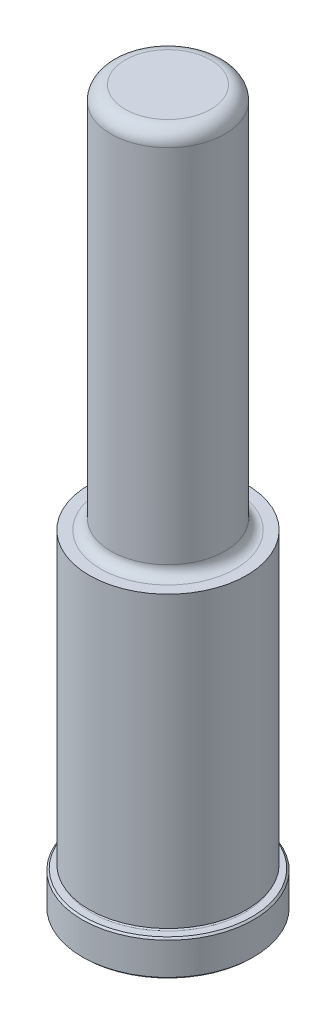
ISO-10303-21;
HEADER;
FILE_DESCRIPTION(('STEP AP214'),'2;1');
FILE_NAME('part.step','',(''),(''),'','','');
FILE_SCHEMA(('AUTOMOTIVE_DESIGN { 1 0 10303 214 1 1 1 1 }'));
ENDSEC;
DATA;
#1=APPLICATION_CONTEXT('core data for automotive mechanical design processes');
#2=APPLICATION_PROTOCOL_DEFINITION('international standard','automotive_design',2000,#1);
#3=PRODUCT_CONTEXT('',#1,'mechanical');
#4=PRODUCT('Part','Part','',(#3));
#5=PRODUCT_RELATED_PRODUCT_CATEGORY('part','',(#4));
#6=PRODUCT_DEFINITION_FORMATION('','',#4);
#7=PRODUCT_DEFINITION_CONTEXT('part definition',#1,'design');
#8=PRODUCT_DEFINITION('design','',#6,#7);
#9=PRODUCT_DEFINITION_SHAPE('','',#8);
#10=(LENGTH_UNIT() NAMED_UNIT(*) SI_UNIT(.MILLI.,.METRE.));
#11=(NAMED_UNIT(*) PLANE_ANGLE_UNIT() SI_UNIT($,.RADIAN.));
#12=(NAMED_UNIT(*) SI_UNIT($,.STERADIAN.) SOLID_ANGLE_UNIT());
#13=UNCERTAINTY_MEASURE_WITH_UNIT(LENGTH_MEASURE(1.E-05),#10,'distance_accuracy_value','');
#14=(GEOMETRIC_REPRESENTATION_CONTEXT(3) GLOBAL_UNCERTAINTY_ASSIGNED_CONTEXT((#13)) GLOBAL_UNIT_ASSIGNED_CONTEXT((#10,
#11,#12)) REPRESENTATION_CONTEXT('',''));
#15=CARTESIAN_POINT('',(0.,0.,0.));
#16=DIRECTION('',(0.,0.,1.));
#17=DIRECTION('',(1.,0.,0.));
#18=AXIS2_PLACEMENT_3D('',#15,#16,#17);
#19=CARTESIAN_POINT('',(0.,0.,0.));
#20=DIRECTION('',(0.,1.,0.));
#21=DIRECTION('',(0.,0.,1.));
#22=AXIS2_PLACEMENT_3D('',#19,#20,#21);
#23=PLANE('',#22);
#24=CARTESIAN_POINT('',(0.,0.,0.));
#25=DIRECTION('',(0.,1.,0.));
#26=DIRECTION('',(0.,0.,1.));
#27=AXIS2_PLACEMENT_3D('',#24,#25,#26);
#28=CIRCLE('',#27,18.669);
#29=CARTESIAN_POINT('',(0.,0.,18.669));
#30=VERTEX_POINT('',#29);
#31=EDGE_CURVE('E46',#30,#30,#28,.F.);
#32=ORIENTED_EDGE('',*,*,#31,.T.);
#33=EDGE_LOOP('',(#32));
#34=FACE_BOUND('',#33,.T.);
#35=ADVANCED_FACE('F31',(#34),#23,.F.);
#36=CARTESIAN_POINT('',(0.,0.,0.));
#37=DIRECTION('',(0.,1.,0.));
#38=DIRECTION('',(0.,0.,1.));
#39=AXIS2_PLACEMENT_3D('',#36,#37,#38);
#40=CYLINDRICAL_SURFACE('',#39,19.05);
#41=CARTESIAN_POINT('',(0.,0.380999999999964,0.));
#42=DIRECTION('',(0.,1.,0.));
#43=DIRECTION('',(0.,0.,1.));
#44=AXIS2_PLACEMENT_3D('',#41,#42,#43);
#45=CIRCLE('',#44,19.05);
#46=CARTESIAN_POINT('',(0.,0.380999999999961,19.05));
#47=VERTEX_POINT('',#46);
#48=EDGE_CURVE('E51',#47,#47,#45,.T.);
#49=ORIENTED_EDGE('',*,*,#48,.T.);
#50=EDGE_LOOP('',(#49));
#51=FACE_BOUND('',#50,.T.);
#52=CARTESIAN_POINT('',(0.,7.54380000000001,0.));
#53=DIRECTION('',(0.,-1.,0.));
#54=DIRECTION('',(0.,0.,-1.));
#55=AXIS2_PLACEMENT_3D('',#52,#53,#54);
#56=CIRCLE('',#55,19.05);
#57=CARTESIAN_POINT('',(0.,7.54380000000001,-19.05));
#58=VERTEX_POINT('',#57);
#59=EDGE_CURVE('E54',#58,#58,#56,.T.);
#60=ORIENTED_EDGE('',*,*,#59,.T.);
#61=EDGE_LOOP('',(#60));
#62=FACE_BOUND('',#61,.T.);
#63=ADVANCED_FACE('F110',(#51,#62),#40,.T.);
#64=CARTESIAN_POINT('',(0.,7.9248,-19.05));
#65=DIRECTION('',(0.,-1.,0.));
#66=DIRECTION('',(0.,0.,-1.));
#67=AXIS2_PLACEMENT_3D('',#64,#65,#66);
#68=PLANE('',#67);
#69=CARTESIAN_POINT('',(0.,7.9248,0.));
#70=DIRECTION('',(0.,-1.,0.));
#71=DIRECTION('',(0.,0.,-1.));
#72=AXIS2_PLACEMENT_3D('',#69,#70,#71);
#73=CIRCLE('',#72,18.669);
#74=CARTESIAN_POINT('',(0.,7.9248,-18.669));
#75=VERTEX_POINT('',#74);
#76=EDGE_CURVE('E42',#75,#75,#73,.F.);
#77=ORIENTED_EDGE('',*,*,#76,.T.);
#78=EDGE_LOOP('',(#77));
#79=FACE_BOUND('',#78,.T.);
#80=CARTESIAN_POINT('',(0.,7.9248,0.));
#81=DIRECTION('',(0.,1.,0.));
#82=DIRECTION('',(0.,0.,1.));
#83=AXIS2_PLACEMENT_3D('',#80,#81,#82);
#84=CIRCLE('',#83,17.0688);
#85=CARTESIAN_POINT('',(0.,7.92479999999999,17.0688));
#86=VERTEX_POINT('',#85);
#87=EDGE_CURVE('E57',#86,#86,#84,.T.);
#88=ORIENTED_EDGE('',*,*,#87,.F.);
#89=EDGE_LOOP('',(#88));
#90=FACE_BOUND('',#89,.T.);
#91=ADVANCED_FACE('F105',(#79,#90),#68,.F.);
#92=CARTESIAN_POINT('',(0.,8.3058,0.));
#93=DIRECTION('',(0.,1.,0.));
#94=DIRECTION('',(0.,0.,1.));
#95=AXIS2_PLACEMENT_3D('',#92,#93,#94);
#96=TOROIDAL_SURFACE('',#95,17.0688,0.381000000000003);
#97=CARTESIAN_POINT('',(0.,8.6868,0.));
#98=DIRECTION('',(0.,1.,0.));
#99=DIRECTION('',(0.,0.,1.));
#100=AXIS2_PLACEMENT_3D('',#97,#98,#99);
#101=CIRCLE('',#100,17.0688);
#102=CARTESIAN_POINT('',(0.,8.6868,17.0688));
#103=VERTEX_POINT('',#102);
#104=EDGE_CURVE('E60',#103,#103,#101,.T.);
#105=ORIENTED_EDGE('',*,*,#104,.F.);
#106=EDGE_LOOP('',(#105));
#107=FACE_BOUND('',#106,.T.);
#108=ORIENTED_EDGE('',*,*,#87,.T.);
#109=EDGE_LOOP('',(#108));
#110=FACE_BOUND('',#109,.T.);
#111=ADVANCED_FACE('F99',(#107,#110),#96,.F.);
#112=CARTESIAN_POINT('',(0.,8.6868,-17.0688));
#113=DIRECTION('',(0.,1.,0.));
#114=DIRECTION('',(0.,0.,1.));
#115=AXIS2_PLACEMENT_3D('',#112,#113,#114);
#116=PLANE('',#115);
#117=CARTESIAN_POINT('',(0.,8.6868,0.));
#118=DIRECTION('',(0.,1.,0.));
#119=DIRECTION('',(0.,0.,1.));
#120=AXIS2_PLACEMENT_3D('',#117,#118,#119);
#121=CIRCLE('',#120,17.4752);
#122=CARTESIAN_POINT('',(0.,8.6868,17.4752));
#123=VERTEX_POINT('',#122);
#124=EDGE_CURVE('E63',#123,#123,#121,.T.);
#125=ORIENTED_EDGE('',*,*,#124,.F.);
#126=EDGE_LOOP('',(#125));
#127=FACE_BOUND('',#126,.T.);
#128=ORIENTED_EDGE('',*,*,#104,.T.);
#129=EDGE_LOOP('',(#128));
#130=FACE_BOUND('',#129,.T.);
#131=ADVANCED_FACE('F93',(#127,#130),#116,.F.);
#132=CARTESIAN_POINT('',(0.,0.,0.));
#133=DIRECTION('',(0.,1.,0.));
#134=DIRECTION('',(0.,0.,1.));
#135=AXIS2_PLACEMENT_3D('',#132,#133,#134);
#136=CYLINDRICAL_SURFACE('',#135,17.4752);
#137=CARTESIAN_POINT('',(0.,73.025,0.));
#138=DIRECTION('',(0.,1.,0.));
#139=DIRECTION('',(0.,0.,1.));
#140=AXIS2_PLACEMENT_3D('',#137,#138,#139);
#141=CIRCLE('',#140,17.4752);
#142=CARTESIAN_POINT('',(0.,73.025,17.4752));
#143=VERTEX_POINT('',#142);
#144=EDGE_CURVE('E66',#143,#143,#141,.T.);
#145=ORIENTED_EDGE('',*,*,#144,.F.);
#146=EDGE_LOOP('',(#145));
#147=FACE_BOUND('',#146,.T.);
#148=ORIENTED_EDGE('',*,*,#124,.T.);
#149=EDGE_LOOP('',(#148));
#150=FACE_BOUND('',#149,.T.);
#151=ADVANCED_FACE('F87',(#147,#150),#136,.T.);
#152=CARTESIAN_POINT('',(0.,73.025,-17.4752));
#153=DIRECTION('',(0.,-1.,0.));
#154=DIRECTION('',(0.,0.,-1.));
#155=AXIS2_PLACEMENT_3D('',#152,#153,#154);
#156=PLANE('',#155);
#157=CARTESIAN_POINT('',(0.,73.025,0.));
#158=DIRECTION('',(0.,1.,0.));
#159=DIRECTION('',(0.,0.,1.));
#160=AXIS2_PLACEMENT_3D('',#157,#158,#159);
#161=CIRCLE('',#160,14.9733);
#162=CARTESIAN_POINT('',(0.,73.025,14.9733));
#163=VERTEX_POINT('',#162);
#164=EDGE_CURVE('E69',#163,#163,#161,.T.);
#165=ORIENTED_EDGE('',*,*,#164,.F.);
#166=EDGE_LOOP('',(#165));
#167=FACE_BOUND('',#166,.T.);
#168=ORIENTED_EDGE('',*,*,#144,.T.);
#169=EDGE_LOOP('',(#168));
#170=FACE_BOUND('',#169,.T.);
#171=ADVANCED_FACE('F81',(#167,#170),#156,.F.);
#172=CARTESIAN_POINT('',(0.,75.311,0.));
#173=DIRECTION('',(0.,1.,0.));
#174=DIRECTION('',(0.,0.,1.));
#175=AXIS2_PLACEMENT_3D('',#172,#173,#174);
#176=TOROIDAL_SURFACE('',#175,14.9733,2.286);
#177=CARTESIAN_POINT('',(0.,75.311,0.));
#178=DIRECTION('',(0.,1.,0.));
#179=DIRECTION('',(0.,0.,1.));
#180=AXIS2_PLACEMENT_3D('',#177,#178,#179);
#181=CIRCLE('',#180,12.6873);
#182=CARTESIAN_POINT('',(0.,75.311,12.6873));
#183=VERTEX_POINT('',#182);
#184=EDGE_CURVE('E72',#183,#183,#181,.T.);
#185=ORIENTED_EDGE('',*,*,#184,.F.);
#186=EDGE_LOOP('',(#185));
#187=FACE_BOUND('',#186,.T.);
#188=ORIENTED_EDGE('',*,*,#164,.T.);
#189=EDGE_LOOP('',(#188));
#190=FACE_BOUND('',#189,.T.);
#191=ADVANCED_FACE('F78',(#187,#190),#176,.F.);
#192=CARTESIAN_POINT('',(0.,0.,0.));
#193=DIRECTION('',(0.,1.,0.));
#194=DIRECTION('',(0.,0.,1.));
#195=AXIS2_PLACEMENT_3D('',#192,#193,#194);
#196=CYLINDRICAL_SURFACE('',#195,12.6873);
#197=CARTESIAN_POINT('',(0.,155.575,0.));
#198=DIRECTION('',(0.,-1.,0.));
#199=DIRECTION('',(0.,0.,-1.));
#200=AXIS2_PLACEMENT_3D('',#197,#198,#199);
#201=CIRCLE('',#200,12.6873);
#202=CARTESIAN_POINT('',(0.,155.575,-12.6873));
#203=VERTEX_POINT('',#202);
#204=EDGE_CURVE('E10',#203,#203,#201,.T.);
#205=ORIENTED_EDGE('',*,*,#204,.T.);
#206=EDGE_LOOP('',(#205));
#207=FACE_BOUND('',#206,.T.);
#208=ORIENTED_EDGE('',*,*,#184,.T.);
#209=EDGE_LOOP('',(#208));
#210=FACE_BOUND('',#209,.T.);
#211=ADVANCED_FACE('F76',(#207,#210),#196,.T.);
#212=CARTESIAN_POINT('',(0.,158.75,-12.6873));
#213=DIRECTION('',(0.,-1.,0.));
#214=DIRECTION('',(0.,0.,-1.));
#215=AXIS2_PLACEMENT_3D('',#212,#213,#214);
#216=PLANE('',#215);
#217=CARTESIAN_POINT('',(0.,158.75,0.));
#218=DIRECTION('',(0.,-1.,0.));
#219=DIRECTION('',(0.,0.,-1.));
#220=AXIS2_PLACEMENT_3D('',#217,#218,#219);
#221=CIRCLE('',#220,9.51230000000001);
#222=CARTESIAN_POINT('',(0.,158.75,-9.51229999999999));
#223=VERTEX_POINT('',#222);
#224=EDGE_CURVE('E38',#223,#223,#221,.F.);
#225=ORIENTED_EDGE('',*,*,#224,.T.);
#226=EDGE_LOOP('',(#225));
#227=FACE_BOUND('',#226,.T.);
#228=ADVANCED_FACE('F127',(#227),#216,.F.);
#229=CARTESIAN_POINT('',(0.,0.380999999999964,0.));
#230=DIRECTION('',(0.,1.,0.));
#231=DIRECTION('',(0.,0.,1.));
#232=AXIS2_PLACEMENT_3D('',#229,#230,#231);
#233=CONICAL_SURFACE('',#232,19.05,0.785398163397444);
#234=ORIENTED_EDGE('',*,*,#31,.F.);
#235=EDGE_LOOP('',(#234));
#236=FACE_BOUND('',#235,.T.);
#237=ORIENTED_EDGE('',*,*,#48,.F.);
#238=EDGE_LOOP('',(#237));
#239=FACE_BOUND('',#238,.T.);
#240=ADVANCED_FACE('F124',(#236,#239),#233,.T.);
#241=CARTESIAN_POINT('',(0.,7.9248,0.));
#242=DIRECTION('',(0.,-1.,0.));
#243=DIRECTION('',(0.,0.,-1.));
#244=AXIS2_PLACEMENT_3D('',#241,#242,#243);
#245=CONICAL_SURFACE('',#244,18.669,0.785398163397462);
#246=ORIENTED_EDGE('',*,*,#59,.F.);
#247=EDGE_LOOP('',(#246));
#248=FACE_BOUND('',#247,.T.);
#249=ORIENTED_EDGE('',*,*,#76,.F.);
#250=EDGE_LOOP('',(#249));
#251=FACE_BOUND('',#250,.T.);
#252=ADVANCED_FACE('F126',(#248,#251),#245,.T.);
#253=CARTESIAN_POINT('',(0.,155.575,0.));
#254=DIRECTION('',(0.,-1.,0.));
#255=DIRECTION('',(0.,0.,-1.));
#256=AXIS2_PLACEMENT_3D('',#253,#254,#255);
#257=TOROIDAL_SURFACE('',#256,9.51230000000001,3.175);
#258=ORIENTED_EDGE('',*,*,#204,.F.);
#259=EDGE_LOOP('',(#258));
#260=FACE_BOUND('',#259,.T.);
#261=ORIENTED_EDGE('',*,*,#224,.F.);
#262=EDGE_LOOP('',(#261));
#263=FACE_BOUND('',#262,.T.);
#264=ADVANCED_FACE('F33',(#260,#263),#257,.T.);
#265=CLOSED_SHELL('',(#35,#63,#91,#111,#131,#151,#171,#191,#211,#228,#240,#252,#264));
#266=MANIFOLD_SOLID_BREP('B2',#265);
#267=ADVANCED_BREP_SHAPE_REPRESENTATION('',(#18,#266),#14);
#268=SHAPE_DEFINITION_REPRESENTATION(#9,#267);
ENDSEC;
END-ISO-10303-21;
